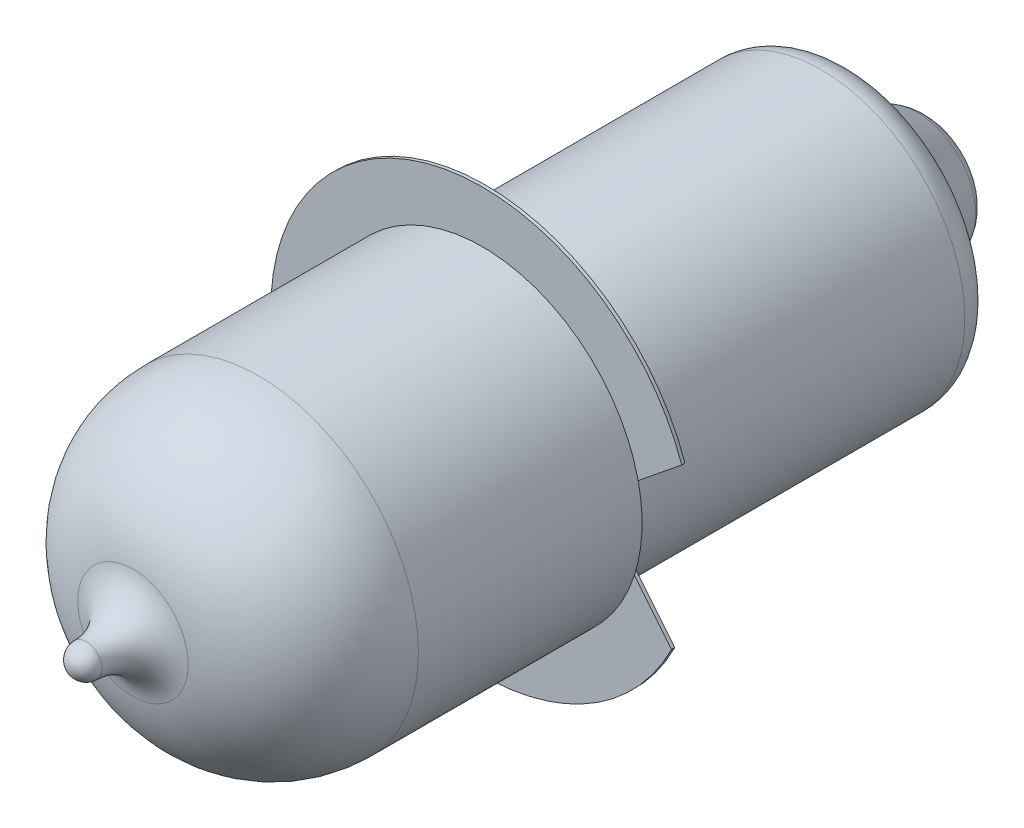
ISO-10303-21;
HEADER;
FILE_DESCRIPTION(('STEP AP214'),'2;1');
FILE_NAME('part.step','',(''),(''),'','','');
FILE_SCHEMA(('AUTOMOTIVE_DESIGN { 1 0 10303 214 1 1 1 1 }'));
ENDSEC;
DATA;
#1=APPLICATION_CONTEXT('core data for automotive mechanical design processes');
#2=APPLICATION_PROTOCOL_DEFINITION('international standard','automotive_design',2000,#1);
#3=PRODUCT_CONTEXT('',#1,'mechanical');
#4=PRODUCT('Part','Part','',(#3));
#5=PRODUCT_RELATED_PRODUCT_CATEGORY('part','',(#4));
#6=PRODUCT_DEFINITION_FORMATION('','',#4);
#7=PRODUCT_DEFINITION_CONTEXT('part definition',#1,'design');
#8=PRODUCT_DEFINITION('design','',#6,#7);
#9=PRODUCT_DEFINITION_SHAPE('','',#8);
#10=(LENGTH_UNIT() NAMED_UNIT(*) SI_UNIT(.MILLI.,.METRE.));
#11=(NAMED_UNIT(*) PLANE_ANGLE_UNIT() SI_UNIT($,.RADIAN.));
#12=(NAMED_UNIT(*) SI_UNIT($,.STERADIAN.) SOLID_ANGLE_UNIT());
#13=UNCERTAINTY_MEASURE_WITH_UNIT(LENGTH_MEASURE(1.E-05),#10,'distance_accuracy_value','');
#14=(GEOMETRIC_REPRESENTATION_CONTEXT(3) GLOBAL_UNCERTAINTY_ASSIGNED_CONTEXT((#13)) GLOBAL_UNIT_ASSIGNED_CONTEXT((#10,
#11,#12)) REPRESENTATION_CONTEXT('',''));
#15=CARTESIAN_POINT('',(0.,0.,0.));
#16=DIRECTION('',(0.,0.,1.));
#17=DIRECTION('',(1.,0.,0.));
#18=AXIS2_PLACEMENT_3D('',#15,#16,#17);
#19=CARTESIAN_POINT('',(0.,0.,11.6));
#20=DIRECTION('',(0.,0.,1.));
#21=DIRECTION('',(1.,0.,0.));
#22=AXIS2_PLACEMENT_3D('',#19,#20,#21);
#23=PLANE('',#22);
#24=DIRECTION('',(0.630325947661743,-0.776330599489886,0.));
#25=VECTOR('',#24,1.);
#26=CARTESIAN_POINT('',(3.52524659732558,-0.00232682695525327,11.6));
#27=LINE('',#26,#25);
#28=CARTESIAN_POINT('',(4.76170194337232,-1.52518674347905,11.6));
#29=VERTEX_POINT('',#28);
#30=CARTESIAN_POINT('',(5.92339768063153,-2.95597021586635,11.6));
#31=VERTEX_POINT('',#30);
#32=EDGE_CURVE('E97',#29,#31,#27,.T.);
#33=ORIENTED_EDGE('',*,*,#32,.F.);
#34=CARTESIAN_POINT('',(0.,0.,11.6));
#35=DIRECTION('',(0.,0.,1.));
#36=DIRECTION('',(1.,0.,0.));
#37=AXIS2_PLACEMENT_3D('',#34,#35,#36);
#38=CIRCLE('',#37,5.);
#39=CARTESIAN_POINT('',(4.87833540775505,1.09628629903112,11.6));
#40=VERTEX_POINT('',#39);
#41=EDGE_CURVE('E87',#40,#29,#38,.T.);
#42=ORIENTED_EDGE('',*,*,#41,.F.);
#43=DIRECTION('',(-0.776330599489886,-0.630325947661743,0.));
#44=VECTOR('',#43,1.);
#45=CARTESIAN_POINT('',(6.24240369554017,2.20381398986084,11.6));
#46=LINE('',#45,#44);
#47=CARTESIAN_POINT('',(6.24240369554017,2.20381398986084,11.6));
#48=VERTEX_POINT('',#47);
#49=EDGE_CURVE('E86',#48,#40,#46,.T.);
#50=ORIENTED_EDGE('',*,*,#49,.F.);
#51=CARTESIAN_POINT('',(0.,0.,11.6));
#52=DIRECTION('',(0.,0.,1.));
#53=DIRECTION('',(1.,0.,0.));
#54=AXIS2_PLACEMENT_3D('',#51,#52,#53);
#55=CIRCLE('',#54,6.62);
#56=EDGE_CURVE('E118',#48,#31,#55,.T.);
#57=ORIENTED_EDGE('',*,*,#56,.T.);
#58=EDGE_LOOP('',(#33,#42,#50,#57));
#59=FACE_BOUND('',#58,.T.);
#60=ADVANCED_FACE('F29',(#59),#23,.T.);
#61=CARTESIAN_POINT('',(0.,0.,0.));
#62=DIRECTION('',(0.,0.,1.));
#63=DIRECTION('',(1.,0.,0.));
#64=AXIS2_PLACEMENT_3D('',#61,#62,#63);
#65=PLANE('',#64);
#66=CARTESIAN_POINT('',(0.,0.,0.));
#67=DIRECTION('',(0.,0.,1.));
#68=DIRECTION('',(1.,0.,0.));
#69=AXIS2_PLACEMENT_3D('',#66,#67,#68);
#70=CIRCLE('',#69,3.5);
#71=CARTESIAN_POINT('',(3.5,0.,0.));
#72=VERTEX_POINT('',#71);
#73=EDGE_CURVE('E129',#72,#72,#70,.F.);
#74=ORIENTED_EDGE('',*,*,#73,.T.);
#75=EDGE_LOOP('',(#74));
#76=FACE_BOUND('',#75,.T.);
#77=CARTESIAN_POINT('',(0.,0.,0.));
#78=DIRECTION('',(0.,0.,1.));
#79=DIRECTION('',(1.,0.,0.));
#80=AXIS2_PLACEMENT_3D('',#77,#78,#79);
#81=CIRCLE('',#80,3.);
#82=CARTESIAN_POINT('',(3.,0.,0.));
#83=VERTEX_POINT('',#82);
#84=EDGE_CURVE('E123',#83,#83,#81,.F.);
#85=ORIENTED_EDGE('',*,*,#84,.F.);
#86=EDGE_LOOP('',(#85));
#87=FACE_BOUND('',#86,.T.);
#88=ADVANCED_FACE('F158',(#76,#87),#65,.F.);
#89=CARTESIAN_POINT('',(0.,0.,11.5));
#90=DIRECTION('',(0.,0.,-1.));
#91=DIRECTION('',(-1.,0.,0.));
#92=AXIS2_PLACEMENT_3D('',#89,#90,#91);
#93=CYLINDRICAL_SURFACE('',#92,4.5);
#94=CARTESIAN_POINT('',(0.,0.,1.));
#95=DIRECTION('',(0.,0.,1.));
#96=DIRECTION('',(1.,0.,0.));
#97=AXIS2_PLACEMENT_3D('',#94,#95,#96);
#98=CIRCLE('',#97,4.5);
#99=CARTESIAN_POINT('',(4.5,0.,1.));
#100=VERTEX_POINT('',#99);
#101=EDGE_CURVE('E126',#100,#100,#98,.T.);
#102=ORIENTED_EDGE('',*,*,#101,.T.);
#103=EDGE_LOOP('',(#102));
#104=FACE_BOUND('',#103,.T.);
#105=CARTESIAN_POINT('',(0.,0.,11.5));
#106=DIRECTION('',(0.,0.,1.));
#107=DIRECTION('',(1.,0.,0.));
#108=AXIS2_PLACEMENT_3D('',#105,#106,#107);
#109=CIRCLE('',#108,4.5);
#110=CARTESIAN_POINT('',(4.43883184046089,0.739440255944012,11.5));
#111=VERTEX_POINT('',#110);
#112=CARTESIAN_POINT('',(4.37580800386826,-1.04990681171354,11.5));
#113=VERTEX_POINT('',#112);
#114=EDGE_CURVE('E120',#111,#113,#109,.T.);
#115=ORIENTED_EDGE('',*,*,#114,.F.);
#116=CARTESIAN_POINT('',(0.,0.,11.5));
#117=DIRECTION('',(0.,0.,1.));
#118=DIRECTION('',(1.,0.,0.));
#119=AXIS2_PLACEMENT_3D('',#116,#117,#118);
#120=CIRCLE('',#119,4.5);
#121=EDGE_CURVE('E110',#113,#111,#120,.T.);
#122=ORIENTED_EDGE('',*,*,#121,.F.);
#123=EDGE_LOOP('',(#115,#122));
#124=FACE_BOUND('',#123,.T.);
#125=ADVANCED_FACE('F31',(#104,#124),#93,.T.);
#126=CARTESIAN_POINT('',(0.,0.,11.5));
#127=DIRECTION('',(0.,0.,1.));
#128=DIRECTION('',(1.,0.,0.));
#129=AXIS2_PLACEMENT_3D('',#126,#127,#128);
#130=PLANE('',#129);
#131=ORIENTED_EDGE('',*,*,#114,.T.);
#132=DIRECTION('',(0.630325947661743,-0.776330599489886,0.));
#133=VECTOR('',#132,1.);
#134=CARTESIAN_POINT('',(3.52524659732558,-0.00232682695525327,11.5));
#135=LINE('',#134,#133);
#136=CARTESIAN_POINT('',(5.92339768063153,-2.95597021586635,11.5));
#137=VERTEX_POINT('',#136);
#138=EDGE_CURVE('E52',#113,#137,#135,.T.);
#139=ORIENTED_EDGE('',*,*,#138,.T.);
#140=CARTESIAN_POINT('',(0.,0.,11.5));
#141=DIRECTION('',(0.,0.,1.));
#142=DIRECTION('',(1.,0.,0.));
#143=AXIS2_PLACEMENT_3D('',#140,#141,#142);
#144=CIRCLE('',#143,6.62);
#145=CARTESIAN_POINT('',(6.24240369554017,2.20381398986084,11.5));
#146=VERTEX_POINT('',#145);
#147=EDGE_CURVE('E115',#146,#137,#144,.T.);
#148=ORIENTED_EDGE('',*,*,#147,.F.);
#149=DIRECTION('',(-0.776330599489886,-0.630325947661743,0.));
#150=VECTOR('',#149,1.);
#151=CARTESIAN_POINT('',(6.24240369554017,2.20381398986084,11.5));
#152=LINE('',#151,#150);
#153=EDGE_CURVE('E102',#146,#111,#152,.T.);
#154=ORIENTED_EDGE('',*,*,#153,.T.);
#155=EDGE_LOOP('',(#131,#139,#148,#154));
#156=FACE_BOUND('',#155,.T.);
#157=ADVANCED_FACE('F166',(#156),#130,.F.);
#158=CARTESIAN_POINT('',(0.,0.,11.6));
#159=DIRECTION('',(0.,0.,-1.));
#160=DIRECTION('',(-1.,0.,0.));
#161=AXIS2_PLACEMENT_3D('',#158,#159,#160);
#162=CYLINDRICAL_SURFACE('',#161,6.62);
#163=ORIENTED_EDGE('',*,*,#147,.T.);
#164=DIRECTION('',(0.,0.,1.));
#165=VECTOR('',#164,1.);
#166=CARTESIAN_POINT('',(5.92339768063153,-2.95597021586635,11.5));
#167=LINE('',#166,#165);
#168=EDGE_CURVE('E107',#137,#31,#167,.T.);
#169=ORIENTED_EDGE('',*,*,#168,.T.);
#170=ORIENTED_EDGE('',*,*,#56,.F.);
#171=DIRECTION('',(0.,0.,1.));
#172=VECTOR('',#171,1.);
#173=CARTESIAN_POINT('',(6.24240369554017,2.20381398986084,11.5));
#174=LINE('',#173,#172);
#175=EDGE_CURVE('E44',#146,#48,#174,.T.);
#176=ORIENTED_EDGE('',*,*,#175,.F.);
#177=EDGE_LOOP('',(#163,#169,#170,#176));
#178=FACE_BOUND('',#177,.T.);
#179=ADVANCED_FACE('F168',(#178),#162,.T.);
#180=CARTESIAN_POINT('',(0.,0.,0.));
#181=DIRECTION('',(0.,0.,1.));
#182=DIRECTION('',(-1.,0.,0.));
#183=AXIS2_PLACEMENT_3D('',#180,#181,#182);
#184=CONICAL_SURFACE('',#183,3.,0.5235987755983);
#185=CARTESIAN_POINT('',(0.,0.,-2.));
#186=DIRECTION('',(0.,0.,1.));
#187=DIRECTION('',(1.,0.,0.));
#188=AXIS2_PLACEMENT_3D('',#185,#186,#187);
#189=CIRCLE('',#188,1.84529946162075);
#190=CARTESIAN_POINT('',(1.84529946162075,0.,-2.));
#191=VERTEX_POINT('',#190);
#192=EDGE_CURVE('E135',#191,#191,#189,.T.);
#193=ORIENTED_EDGE('',*,*,#192,.T.);
#194=EDGE_LOOP('',(#193));
#195=FACE_BOUND('',#194,.T.);
#196=ORIENTED_EDGE('',*,*,#84,.T.);
#197=EDGE_LOOP('',(#196));
#198=FACE_BOUND('',#197,.T.);
#199=ADVANCED_FACE('F170',(#195,#198),#184,.T.);
#200=CARTESIAN_POINT('',(0.,0.,-2.5));
#201=DIRECTION('',(0.,0.,-1.));
#202=DIRECTION('',(-1.,0.,0.));
#203=AXIS2_PLACEMENT_3D('',#200,#201,#202);
#204=PLANE('',#203);
#205=CARTESIAN_POINT('',(0.,0.,-2.5));
#206=DIRECTION('',(0.,0.,-1.));
#207=DIRECTION('',(-1.,0.,0.));
#208=AXIS2_PLACEMENT_3D('',#205,#206,#207);
#209=CIRCLE('',#208,0.979274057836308);
#210=CARTESIAN_POINT('',(-0.979274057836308,0.,-2.5));
#211=VERTEX_POINT('',#210);
#212=EDGE_CURVE('E132',#211,#211,#209,.T.);
#213=ORIENTED_EDGE('',*,*,#212,.T.);
#214=EDGE_LOOP('',(#213));
#215=FACE_BOUND('',#214,.T.);
#216=ADVANCED_FACE('F176',(#215),#204,.T.);
#217=CARTESIAN_POINT('',(0.,0.,1.));
#218=DIRECTION('',(0.,0.,1.));
#219=DIRECTION('',(1.,0.,0.));
#220=AXIS2_PLACEMENT_3D('',#217,#218,#219);
#221=TOROIDAL_SURFACE('',#220,3.5,1.);
#222=ORIENTED_EDGE('',*,*,#73,.F.);
#223=EDGE_LOOP('',(#222));
#224=FACE_BOUND('',#223,.T.);
#225=ORIENTED_EDGE('',*,*,#101,.F.);
#226=EDGE_LOOP('',(#225));
#227=FACE_BOUND('',#226,.T.);
#228=ADVANCED_FACE('F200',(#224,#227),#221,.T.);
#229=CARTESIAN_POINT('',(0.,0.,-1.5));
#230=DIRECTION('',(0.,0.,-1.));
#231=DIRECTION('',(-1.,0.,0.));
#232=AXIS2_PLACEMENT_3D('',#229,#230,#231);
#233=DEGENERATE_TOROIDAL_SURFACE('',#232,0.979274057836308,1.,.T.);
#234=ORIENTED_EDGE('',*,*,#192,.F.);
#235=EDGE_LOOP('',(#234));
#236=FACE_BOUND('',#235,.T.);
#237=ORIENTED_EDGE('',*,*,#212,.F.);
#238=EDGE_LOOP('',(#237));
#239=FACE_BOUND('',#238,.T.);
#240=ADVANCED_FACE('F194',(#236,#239),#233,.T.);
#241=CARTESIAN_POINT('',(0.,0.,11.5));
#242=DIRECTION('',(0.,0.,1.));
#243=DIRECTION('',(1.,0.,0.));
#244=AXIS2_PLACEMENT_3D('',#241,#242,#243);
#245=PLANE('',#244);
#246=ORIENTED_EDGE('',*,*,#121,.T.);
#247=CARTESIAN_POINT('',(3.52524659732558,-0.00232682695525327,11.5));
#248=VERTEX_POINT('',#247);
#249=EDGE_CURVE('E101',#111,#248,#152,.T.);
#250=ORIENTED_EDGE('',*,*,#249,.T.);
#251=EDGE_CURVE('E105',#248,#113,#135,.T.);
#252=ORIENTED_EDGE('',*,*,#251,.T.);
#253=EDGE_LOOP('',(#246,#250,#252));
#254=FACE_BOUND('',#253,.T.);
#255=ADVANCED_FACE('F185',(#254),#245,.T.);
#256=CARTESIAN_POINT('',(3.52524659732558,-0.00232682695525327,11.5));
#257=DIRECTION('',(-0.776330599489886,-0.630325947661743,0.));
#258=DIRECTION('',(0.630325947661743,-0.776330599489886,0.));
#259=AXIS2_PLACEMENT_3D('',#256,#257,#258);
#260=PLANE('',#259);
#261=CARTESIAN_POINT('',(3.52524659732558,-0.00232682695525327,11.6));
#262=VERTEX_POINT('',#261);
#263=EDGE_CURVE('E83',#262,#29,#27,.T.);
#264=ORIENTED_EDGE('',*,*,#263,.T.);
#265=ORIENTED_EDGE('',*,*,#32,.T.);
#266=ORIENTED_EDGE('',*,*,#168,.F.);
#267=ORIENTED_EDGE('',*,*,#138,.F.);
#268=ORIENTED_EDGE('',*,*,#251,.F.);
#269=DIRECTION('',(0.,0.,1.));
#270=VECTOR('',#269,1.);
#271=CARTESIAN_POINT('',(3.52524659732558,-0.00232682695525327,11.5));
#272=LINE('',#271,#270);
#273=EDGE_CURVE('E111',#248,#262,#272,.T.);
#274=ORIENTED_EDGE('',*,*,#273,.T.);
#275=EDGE_LOOP('',(#264,#265,#266,#267,#268,#274));
#276=FACE_BOUND('',#275,.T.);
#277=ADVANCED_FACE('F186',(#276),#260,.F.);
#278=CARTESIAN_POINT('',(6.24240369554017,2.20381398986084,11.5));
#279=DIRECTION('',(-0.630325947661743,0.776330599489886,0.));
#280=DIRECTION('',(-0.776330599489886,-0.630325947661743,0.));
#281=AXIS2_PLACEMENT_3D('',#278,#279,#280);
#282=PLANE('',#281);
#283=ORIENTED_EDGE('',*,*,#49,.T.);
#284=EDGE_CURVE('E77',#40,#262,#46,.T.);
#285=ORIENTED_EDGE('',*,*,#284,.T.);
#286=ORIENTED_EDGE('',*,*,#273,.F.);
#287=ORIENTED_EDGE('',*,*,#249,.F.);
#288=ORIENTED_EDGE('',*,*,#153,.F.);
#289=ORIENTED_EDGE('',*,*,#175,.T.);
#290=EDGE_LOOP('',(#283,#285,#286,#287,#288,#289));
#291=FACE_BOUND('',#290,.T.);
#292=ADVANCED_FACE('F98',(#291),#282,.F.);
#293=CARTESIAN_POINT('',(0.,0.,11.6));
#294=DIRECTION('',(0.,0.,1.));
#295=DIRECTION('',(1.,0.,0.));
#296=AXIS2_PLACEMENT_3D('',#293,#294,#295);
#297=PLANE('',#296);
#298=EDGE_CURVE('E80',#29,#40,#38,.T.);
#299=ORIENTED_EDGE('',*,*,#298,.F.);
#300=ORIENTED_EDGE('',*,*,#263,.F.);
#301=ORIENTED_EDGE('',*,*,#284,.F.);
#302=EDGE_LOOP('',(#299,#300,#301));
#303=FACE_BOUND('',#302,.T.);
#304=ADVANCED_FACE('F79',(#303),#297,.F.);
#305=CARTESIAN_POINT('',(0.,0.,22.6));
#306=DIRECTION('',(0.,0.,-1.));
#307=DIRECTION('',(-1.,0.,0.));
#308=AXIS2_PLACEMENT_3D('',#305,#306,#307);
#309=CYLINDRICAL_SURFACE('',#308,5.);
#310=CARTESIAN_POINT('',(0.,0.,18.6));
#311=DIRECTION('',(0.,0.,1.));
#312=DIRECTION('',(1.,0.,0.));
#313=AXIS2_PLACEMENT_3D('',#310,#311,#312);
#314=CIRCLE('',#313,5.);
#315=CARTESIAN_POINT('',(5.,0.,18.6));
#316=VERTEX_POINT('',#315);
#317=EDGE_CURVE('E138',#316,#316,#314,.F.);
#318=ORIENTED_EDGE('',*,*,#317,.T.);
#319=EDGE_LOOP('',(#318));
#320=FACE_BOUND('',#319,.T.);
#321=ORIENTED_EDGE('',*,*,#41,.T.);
#322=ORIENTED_EDGE('',*,*,#298,.T.);
#323=EDGE_LOOP('',(#321,#322));
#324=FACE_BOUND('',#323,.T.);
#325=ADVANCED_FACE('F91',(#320,#324),#309,.T.);
#326=CARTESIAN_POINT('',(0.,0.,18.6));
#327=DIRECTION('',(0.,0.,1.));
#328=DIRECTION('',(1.,0.,0.));
#329=AXIS2_PLACEMENT_3D('',#326,#327,#328);
#330=DEGENERATE_TOROIDAL_SURFACE('',#329,1.,4.,.T.);
#331=CARTESIAN_POINT('',(0.,0.,22.5333309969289));
#332=DIRECTION('',(0.,0.,-1.));
#333=DIRECTION('',(0.,1.,0.));
#334=AXIS2_PLACEMENT_3D('',#331,#332,#333);
#335=CIRCLE('',#334,1.72726011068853);
#336=CARTESIAN_POINT('',(0.,1.72726011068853,22.5333309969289));
#337=VERTEX_POINT('',#336);
#338=EDGE_CURVE('E37',#337,#337,#335,.T.);
#339=ORIENTED_EDGE('',*,*,#338,.T.);
#340=EDGE_LOOP('',(#339));
#341=FACE_BOUND('',#340,.T.);
#342=ORIENTED_EDGE('',*,*,#317,.F.);
#343=EDGE_LOOP('',(#342));
#344=FACE_BOUND('',#343,.T.);
#345=ADVANCED_FACE('F143',(#341,#344),#330,.T.);
#346=CARTESIAN_POINT('',(0.,0.,24.));
#347=DIRECTION('',(0.,0.,1.));
#348=DIRECTION('',(0.,1.,0.));
#349=AXIS2_PLACEMENT_3D('',#346,#347,#348);
#350=SPHERICAL_SURFACE('',#349,0.5);
#351=CARTESIAN_POINT('',(0.,0.,24.0020825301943));
#352=DIRECTION('',(0.,0.,-1.));
#353=DIRECTION('',(0.,1.,0.));
#354=AXIS2_PLACEMENT_3D('',#351,#352,#353);
#355=CIRCLE('',#354,0.499995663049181);
#356=CARTESIAN_POINT('',(0.,0.499995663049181,24.0020825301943));
#357=VERTEX_POINT('',#356);
#358=EDGE_CURVE('E11',#357,#357,#355,.F.);
#359=ORIENTED_EDGE('',*,*,#358,.T.);
#360=EDGE_LOOP('',(#359));
#361=FACE_BOUND('',#360,.T.);
#362=ADVANCED_FACE('F148',(#361),#350,.T.);
#363=CARTESIAN_POINT('',(0.,0.,24.0083301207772));
#364=DIRECTION('',(0.,0.,1.));
#365=DIRECTION('',(0.,-1.,0.));
#366=AXIS2_PLACEMENT_3D('',#363,#364,#365);
#367=TOROIDAL_SURFACE('',#366,1.99998265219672,1.5);
#368=ORIENTED_EDGE('',*,*,#358,.F.);
#369=EDGE_LOOP('',(#368));
#370=FACE_BOUND('',#369,.T.);
#371=ORIENTED_EDGE('',*,*,#338,.F.);
#372=EDGE_LOOP('',(#371));
#373=FACE_BOUND('',#372,.T.);
#374=ADVANCED_FACE('F146',(#370,#373),#367,.F.);
#375=CLOSED_SHELL('',(#60,#88,#125,#157,#179,#199,#216,#228,#240,#255,#277,#292,#304,#325,#345,
#362,#374));
#376=MANIFOLD_SOLID_BREP('B2',#375);
#377=ADVANCED_BREP_SHAPE_REPRESENTATION('',(#18,#376),#14);
#378=SHAPE_DEFINITION_REPRESENTATION(#9,#377);
ENDSEC;
END-ISO-10303-21;
